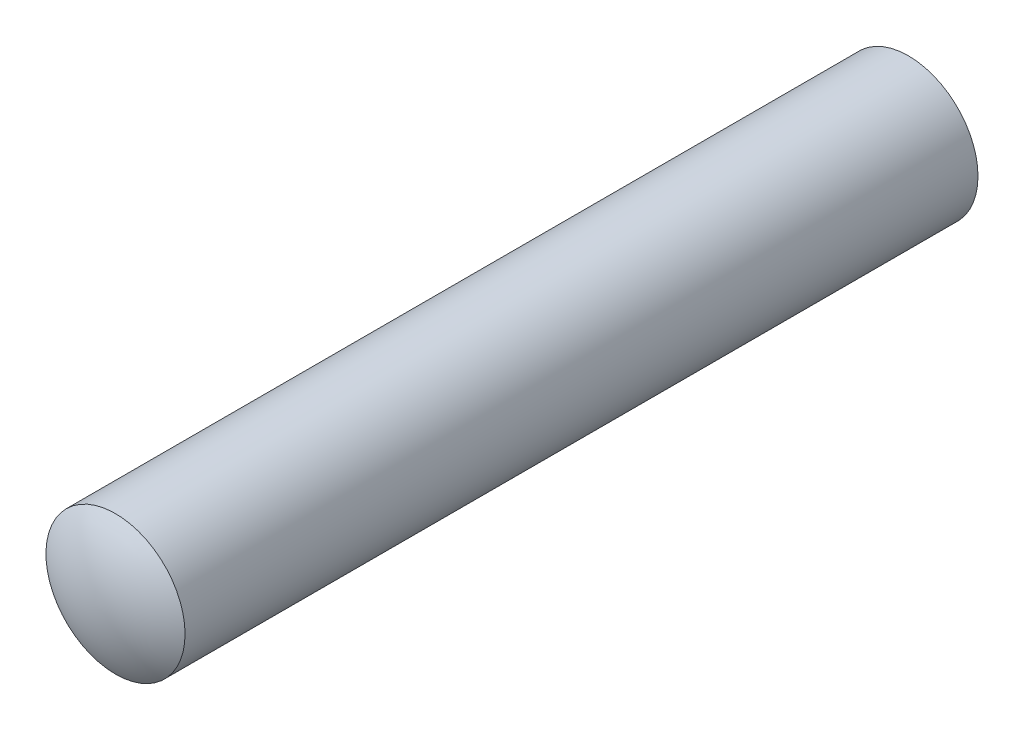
from build123d import *


with BuildPart() as part:
    # E_corps → Corps (revolve)
    with BuildSketch(Plane(origin=(0, 0, 0), x_dir=(0, 0, -1), z_dir=(1, 0, 0)), mode=Mode.PRIVATE) as corps_sk:
        with BuildLine():
            Line((0, 0), (12, 0))
            ThreePointArc((12, 0), (11.923384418, 0.522015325), (11.7, 1))
            Line((11.7, 1), (0.3, 1))
            ThreePointArc((0.3, 1), (0.076615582, 0.522015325), (0, 0))
        make_face()
    revolve(corps_sk.sketch.rotate(Axis((0, 0, 10.722897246), (0, 0, -1)), 90), axis=Axis((0, 0, 10.722897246), (0, 0, -1)))


solid = part.part
